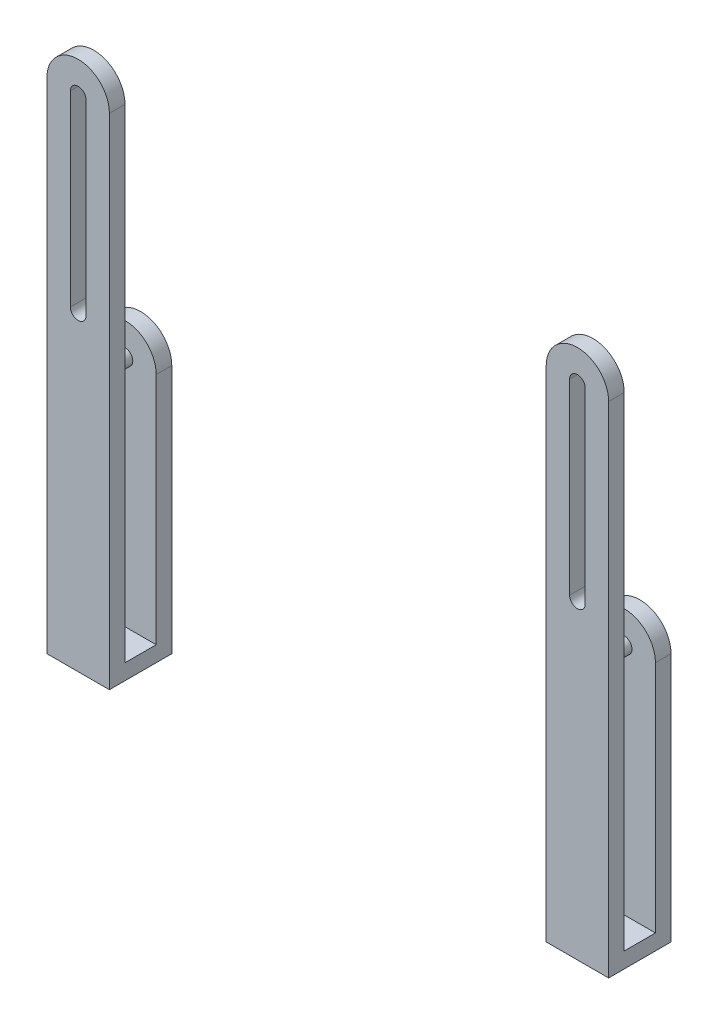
ISO-10303-21;
HEADER;
FILE_DESCRIPTION(('STEP AP214'),'2;1');
FILE_NAME('part.step','',(''),(''),'','','');
FILE_SCHEMA(('AUTOMOTIVE_DESIGN { 1 0 10303 214 1 1 1 1 }'));
ENDSEC;
DATA;
#1=APPLICATION_CONTEXT('core data for automotive mechanical design processes');
#2=APPLICATION_PROTOCOL_DEFINITION('international standard','automotive_design',2000,#1);
#3=PRODUCT_CONTEXT('',#1,'mechanical');
#4=PRODUCT('Part','Part','',(#3));
#5=PRODUCT_RELATED_PRODUCT_CATEGORY('part','',(#4));
#6=PRODUCT_DEFINITION_FORMATION('','',#4);
#7=PRODUCT_DEFINITION_CONTEXT('part definition',#1,'design');
#8=PRODUCT_DEFINITION('design','',#6,#7);
#9=PRODUCT_DEFINITION_SHAPE('','',#8);
#10=(LENGTH_UNIT() NAMED_UNIT(*) SI_UNIT(.MILLI.,.METRE.));
#11=(NAMED_UNIT(*) PLANE_ANGLE_UNIT() SI_UNIT($,.RADIAN.));
#12=(NAMED_UNIT(*) SI_UNIT($,.STERADIAN.) SOLID_ANGLE_UNIT());
#13=UNCERTAINTY_MEASURE_WITH_UNIT(LENGTH_MEASURE(1.E-05),#10,'distance_accuracy_value','');
#14=(GEOMETRIC_REPRESENTATION_CONTEXT(3) GLOBAL_UNCERTAINTY_ASSIGNED_CONTEXT((#13)) GLOBAL_UNIT_ASSIGNED_CONTEXT((#10,
#11,#12)) REPRESENTATION_CONTEXT('',''));
#15=CARTESIAN_POINT('',(0.,0.,0.));
#16=DIRECTION('',(0.,0.,1.));
#17=DIRECTION('',(1.,0.,0.));
#18=AXIS2_PLACEMENT_3D('',#15,#16,#17);
#19=CARTESIAN_POINT('',(-406.4,203.2,12.7));
#20=DIRECTION('',(0.,0.,1.));
#21=DIRECTION('',(1.,0.,0.));
#22=AXIS2_PLACEMENT_3D('',#19,#20,#21);
#23=PLANE('',#22);
#24=DIRECTION('',(-1.,0.,0.));
#25=VECTOR('',#24,1.);
#26=CARTESIAN_POINT('',(-431.8,12.7,12.7));
#27=LINE('',#26,#25);
#28=CARTESIAN_POINT('',(-381.,12.7,12.7));
#29=VERTEX_POINT('',#28);
#30=CARTESIAN_POINT('',(-431.8,12.7,12.7));
#31=VERTEX_POINT('',#30);
#32=EDGE_CURVE('E182',#29,#31,#27,.T.);
#33=ORIENTED_EDGE('',*,*,#32,.F.);
#34=DIRECTION('',(0.,1.,0.));
#35=VECTOR('',#34,1.);
#36=CARTESIAN_POINT('',(-381.,0.,12.7));
#37=LINE('',#36,#35);
#38=CARTESIAN_POINT('',(-381.,203.2,12.7));
#39=VERTEX_POINT('',#38);
#40=EDGE_CURVE('E187',#29,#39,#37,.T.);
#41=ORIENTED_EDGE('',*,*,#40,.T.);
#42=CARTESIAN_POINT('',(-406.4,203.2,12.7));
#43=DIRECTION('',(0.,0.,1.));
#44=DIRECTION('',(1.,0.,0.));
#45=AXIS2_PLACEMENT_3D('',#42,#43,#44);
#46=CIRCLE('',#45,25.4);
#47=CARTESIAN_POINT('',(-431.8,203.2,12.7));
#48=VERTEX_POINT('',#47);
#49=EDGE_CURVE('E223',#39,#48,#46,.T.);
#50=ORIENTED_EDGE('',*,*,#49,.T.);
#51=DIRECTION('',(0.,-1.,0.));
#52=VECTOR('',#51,1.);
#53=CARTESIAN_POINT('',(-431.8,203.2,12.7));
#54=LINE('',#53,#52);
#55=EDGE_CURVE('E212',#48,#31,#54,.T.);
#56=ORIENTED_EDGE('',*,*,#55,.T.);
#57=EDGE_LOOP('',(#33,#41,#50,#56));
#58=FACE_BOUND('',#57,.T.);
#59=CARTESIAN_POINT('',(-406.4,203.2,12.7));
#60=DIRECTION('',(0.,0.,1.));
#61=DIRECTION('',(1.,0.,0.));
#62=AXIS2_PLACEMENT_3D('',#59,#60,#61);
#63=CIRCLE('',#62,6.35);
#64=CARTESIAN_POINT('',(-412.75,203.2,12.7));
#65=VERTEX_POINT('',#64);
#66=EDGE_CURVE('E326',#65,#65,#63,.T.);
#67=ORIENTED_EDGE('',*,*,#66,.F.);
#68=EDGE_LOOP('',(#67));
#69=FACE_BOUND('',#68,.T.);
#70=ADVANCED_FACE('F42',(#58,#69),#23,.T.);
#71=CARTESIAN_POINT('',(-431.8,203.2,12.7));
#72=DIRECTION('',(1.,0.,0.));
#73=DIRECTION('',(0.,1.,0.));
#74=AXIS2_PLACEMENT_3D('',#71,#72,#73);
#75=PLANE('',#74);
#76=DIRECTION('',(0.,-1.,0.));
#77=VECTOR('',#76,1.);
#78=CARTESIAN_POINT('',(-431.8,203.2,0.));
#79=LINE('',#78,#77);
#80=CARTESIAN_POINT('',(-431.8,203.2,0.));
#81=VERTEX_POINT('',#80);
#82=CARTESIAN_POINT('',(-431.8,0.,0.));
#83=VERTEX_POINT('',#82);
#84=EDGE_CURVE('E197',#81,#83,#79,.T.);
#85=ORIENTED_EDGE('',*,*,#84,.T.);
#86=DIRECTION('',(0.,0.,-1.));
#87=VECTOR('',#86,1.);
#88=CARTESIAN_POINT('',(-431.8,0.,12.7));
#89=LINE('',#88,#87);
#90=CARTESIAN_POINT('',(-431.8,0.,50.8));
#91=VERTEX_POINT('',#90);
#92=EDGE_CURVE('E12',#91,#83,#89,.T.);
#93=ORIENTED_EDGE('',*,*,#92,.F.);
#94=DIRECTION('',(0.,-1.,0.));
#95=VECTOR('',#94,1.);
#96=CARTESIAN_POINT('',(-431.8,0.,50.8));
#97=LINE('',#96,#95);
#98=CARTESIAN_POINT('',(-431.8,406.4,50.8));
#99=VERTEX_POINT('',#98);
#100=EDGE_CURVE('E258',#99,#91,#97,.T.);
#101=ORIENTED_EDGE('',*,*,#100,.F.);
#102=DIRECTION('',(0.,0.,-1.));
#103=VECTOR('',#102,1.);
#104=CARTESIAN_POINT('',(-431.8,406.4,50.8));
#105=LINE('',#104,#103);
#106=CARTESIAN_POINT('',(-431.8,406.4,38.1));
#107=VERTEX_POINT('',#106);
#108=EDGE_CURVE('E246',#99,#107,#105,.T.);
#109=ORIENTED_EDGE('',*,*,#108,.T.);
#110=DIRECTION('',(0.,-1.,0.));
#111=VECTOR('',#110,1.);
#112=CARTESIAN_POINT('',(-431.8,0.,38.1));
#113=LINE('',#112,#111);
#114=CARTESIAN_POINT('',(-431.8,12.7,38.1));
#115=VERTEX_POINT('',#114);
#116=EDGE_CURVE('E176',#107,#115,#113,.T.);
#117=ORIENTED_EDGE('',*,*,#116,.T.);
#118=DIRECTION('',(0.,0.,-1.));
#119=VECTOR('',#118,1.);
#120=CARTESIAN_POINT('',(-431.8,12.7,38.1));
#121=LINE('',#120,#119);
#122=EDGE_CURVE('E190',#115,#31,#121,.T.);
#123=ORIENTED_EDGE('',*,*,#122,.T.);
#124=ORIENTED_EDGE('',*,*,#55,.F.);
#125=DIRECTION('',(0.,0.,-1.));
#126=VECTOR('',#125,1.);
#127=CARTESIAN_POINT('',(-431.8,203.2,12.7));
#128=LINE('',#127,#126);
#129=EDGE_CURVE('E222',#48,#81,#128,.T.);
#130=ORIENTED_EDGE('',*,*,#129,.T.);
#131=EDGE_LOOP('',(#85,#93,#101,#109,#117,#123,#124,#130));
#132=FACE_BOUND('',#131,.T.);
#133=ADVANCED_FACE('F44',(#132),#75,.F.);
#134=CARTESIAN_POINT('',(-431.8,0.,12.7));
#135=DIRECTION('',(0.,1.,0.));
#136=DIRECTION('',(0.,0.,1.));
#137=AXIS2_PLACEMENT_3D('',#134,#135,#136);
#138=PLANE('',#137);
#139=DIRECTION('',(1.,0.,0.));
#140=VECTOR('',#139,1.);
#141=CARTESIAN_POINT('',(-431.8,0.,0.));
#142=LINE('',#141,#140);
#143=CARTESIAN_POINT('',(-381.,0.,0.));
#144=VERTEX_POINT('',#143);
#145=EDGE_CURVE('E202',#83,#144,#142,.T.);
#146=ORIENTED_EDGE('',*,*,#145,.T.);
#147=DIRECTION('',(0.,0.,-1.));
#148=VECTOR('',#147,1.);
#149=CARTESIAN_POINT('',(-381.,0.,12.7));
#150=LINE('',#149,#148);
#151=CARTESIAN_POINT('',(-381.,0.,50.8));
#152=VERTEX_POINT('',#151);
#153=EDGE_CURVE('E52',#152,#144,#150,.T.);
#154=ORIENTED_EDGE('',*,*,#153,.F.);
#155=DIRECTION('',(1.,0.,0.));
#156=VECTOR('',#155,1.);
#157=CARTESIAN_POINT('',(-381.,0.,50.8));
#158=LINE('',#157,#156);
#159=EDGE_CURVE('E247',#91,#152,#158,.T.);
#160=ORIENTED_EDGE('',*,*,#159,.F.);
#161=ORIENTED_EDGE('',*,*,#92,.T.);
#162=EDGE_LOOP('',(#146,#154,#160,#161));
#163=FACE_BOUND('',#162,.T.);
#164=ADVANCED_FACE('F271',(#163),#138,.F.);
#165=CARTESIAN_POINT('',(-381.,0.,12.7));
#166=DIRECTION('',(-1.,0.,0.));
#167=DIRECTION('',(0.,0.,1.));
#168=AXIS2_PLACEMENT_3D('',#165,#166,#167);
#169=PLANE('',#168);
#170=DIRECTION('',(0.,1.,0.));
#171=VECTOR('',#170,1.);
#172=CARTESIAN_POINT('',(-381.,0.,0.));
#173=LINE('',#172,#171);
#174=CARTESIAN_POINT('',(-381.,203.2,0.));
#175=VERTEX_POINT('',#174);
#176=EDGE_CURVE('E206',#144,#175,#173,.T.);
#177=ORIENTED_EDGE('',*,*,#176,.T.);
#178=DIRECTION('',(0.,0.,-1.));
#179=VECTOR('',#178,1.);
#180=CARTESIAN_POINT('',(-381.,203.2,12.7));
#181=LINE('',#180,#179);
#182=EDGE_CURVE('E219',#39,#175,#181,.T.);
#183=ORIENTED_EDGE('',*,*,#182,.F.);
#184=ORIENTED_EDGE('',*,*,#40,.F.);
#185=DIRECTION('',(0.,0.,-1.));
#186=VECTOR('',#185,1.);
#187=CARTESIAN_POINT('',(-381.,12.7,38.1));
#188=LINE('',#187,#186);
#189=CARTESIAN_POINT('',(-381.,12.7,38.1));
#190=VERTEX_POINT('',#189);
#191=EDGE_CURVE('E193',#190,#29,#188,.T.);
#192=ORIENTED_EDGE('',*,*,#191,.F.);
#193=DIRECTION('',(0.,1.,0.));
#194=VECTOR('',#193,1.);
#195=CARTESIAN_POINT('',(-381.,406.4,38.1));
#196=LINE('',#195,#194);
#197=CARTESIAN_POINT('',(-381.,406.4,38.1));
#198=VERTEX_POINT('',#197);
#199=EDGE_CURVE('E140',#190,#198,#196,.T.);
#200=ORIENTED_EDGE('',*,*,#199,.T.);
#201=DIRECTION('',(0.,0.,-1.));
#202=VECTOR('',#201,1.);
#203=CARTESIAN_POINT('',(-381.,406.4,50.8));
#204=LINE('',#203,#202);
#205=CARTESIAN_POINT('',(-381.,406.4,50.8));
#206=VERTEX_POINT('',#205);
#207=EDGE_CURVE('E186',#206,#198,#204,.T.);
#208=ORIENTED_EDGE('',*,*,#207,.F.);
#209=DIRECTION('',(0.,1.,0.));
#210=VECTOR('',#209,1.);
#211=CARTESIAN_POINT('',(-381.,406.4,50.8));
#212=LINE('',#211,#210);
#213=EDGE_CURVE('E249',#152,#206,#212,.T.);
#214=ORIENTED_EDGE('',*,*,#213,.F.);
#215=ORIENTED_EDGE('',*,*,#153,.T.);
#216=EDGE_LOOP('',(#177,#183,#184,#192,#200,#208,#214,#215));
#217=FACE_BOUND('',#216,.T.);
#218=ADVANCED_FACE('F231',(#217),#169,.F.);
#219=CARTESIAN_POINT('',(-406.4,203.2,12.7));
#220=DIRECTION('',(0.,0.,-1.));
#221=DIRECTION('',(-1.,0.,0.));
#222=AXIS2_PLACEMENT_3D('',#219,#220,#221);
#223=CYLINDRICAL_SURFACE('',#222,25.4);
#224=CARTESIAN_POINT('',(-406.4,203.2,0.));
#225=DIRECTION('',(0.,0.,1.));
#226=DIRECTION('',(1.,0.,0.));
#227=AXIS2_PLACEMENT_3D('',#224,#225,#226);
#228=CIRCLE('',#227,25.4);
#229=EDGE_CURVE('E210',#175,#81,#228,.T.);
#230=ORIENTED_EDGE('',*,*,#229,.T.);
#231=ORIENTED_EDGE('',*,*,#129,.F.);
#232=ORIENTED_EDGE('',*,*,#49,.F.);
#233=ORIENTED_EDGE('',*,*,#182,.T.);
#234=EDGE_LOOP('',(#230,#231,#232,#233));
#235=FACE_BOUND('',#234,.T.);
#236=ADVANCED_FACE('F235',(#235),#223,.T.);
#237=CARTESIAN_POINT('',(-406.4,203.2,0.));
#238=DIRECTION('',(0.,0.,1.));
#239=DIRECTION('',(1.,0.,0.));
#240=AXIS2_PLACEMENT_3D('',#237,#238,#239);
#241=PLANE('',#240);
#242=ORIENTED_EDGE('',*,*,#84,.F.);
#243=ORIENTED_EDGE('',*,*,#229,.F.);
#244=ORIENTED_EDGE('',*,*,#176,.F.);
#245=ORIENTED_EDGE('',*,*,#145,.F.);
#246=EDGE_LOOP('',(#242,#243,#244,#245));
#247=FACE_BOUND('',#246,.T.);
#248=ADVANCED_FACE('F270',(#247),#241,.F.);
#249=CARTESIAN_POINT('',(-431.8,12.7,38.1));
#250=DIRECTION('',(0.,-1.,0.));
#251=DIRECTION('',(0.,0.,-1.));
#252=AXIS2_PLACEMENT_3D('',#249,#250,#251);
#253=PLANE('',#252);
#254=ORIENTED_EDGE('',*,*,#32,.T.);
#255=ORIENTED_EDGE('',*,*,#122,.F.);
#256=DIRECTION('',(-1.,0.,0.));
#257=VECTOR('',#256,1.);
#258=CARTESIAN_POINT('',(-431.8,12.7,38.1));
#259=LINE('',#258,#257);
#260=EDGE_CURVE('E46',#190,#115,#259,.T.);
#261=ORIENTED_EDGE('',*,*,#260,.F.);
#262=ORIENTED_EDGE('',*,*,#191,.T.);
#263=EDGE_LOOP('',(#254,#255,#261,#262));
#264=FACE_BOUND('',#263,.T.);
#265=ADVANCED_FACE('F238',(#264),#253,.F.);
#266=CARTESIAN_POINT('',(-406.4,406.4,50.8));
#267=DIRECTION('',(0.,0.,-1.));
#268=DIRECTION('',(-1.,0.,0.));
#269=AXIS2_PLACEMENT_3D('',#266,#267,#268);
#270=CYLINDRICAL_SURFACE('',#269,25.4);
#271=CARTESIAN_POINT('',(-406.4,406.4,38.1));
#272=DIRECTION('',(0.,0.,1.));
#273=DIRECTION('',(-1.,0.,0.));
#274=AXIS2_PLACEMENT_3D('',#271,#272,#273);
#275=CIRCLE('',#274,25.4);
#276=EDGE_CURVE('E171',#198,#107,#275,.T.);
#277=ORIENTED_EDGE('',*,*,#276,.T.);
#278=ORIENTED_EDGE('',*,*,#108,.F.);
#279=CARTESIAN_POINT('',(-406.4,406.4,50.8));
#280=DIRECTION('',(0.,0.,1.));
#281=DIRECTION('',(-1.,0.,0.));
#282=AXIS2_PLACEMENT_3D('',#279,#280,#281);
#283=CIRCLE('',#282,25.4);
#284=EDGE_CURVE('E256',#206,#99,#283,.T.);
#285=ORIENTED_EDGE('',*,*,#284,.F.);
#286=ORIENTED_EDGE('',*,*,#207,.T.);
#287=EDGE_LOOP('',(#277,#278,#285,#286));
#288=FACE_BOUND('',#287,.T.);
#289=ADVANCED_FACE('F253',(#288),#270,.T.);
#290=CARTESIAN_POINT('',(-406.4,406.4,50.8));
#291=DIRECTION('',(0.,0.,-1.));
#292=DIRECTION('',(-1.,0.,0.));
#293=AXIS2_PLACEMENT_3D('',#290,#291,#292);
#294=PLANE('',#293);
#295=DIRECTION('',(0.,-1.,0.));
#296=VECTOR('',#295,1.);
#297=CARTESIAN_POINT('',(-412.75,406.4,50.8));
#298=LINE('',#297,#296);
#299=CARTESIAN_POINT('',(-412.75,406.4,50.8));
#300=VERTEX_POINT('',#299);
#301=CARTESIAN_POINT('',(-412.75,254.,50.8));
#302=VERTEX_POINT('',#301);
#303=EDGE_CURVE('E153',#300,#302,#298,.T.);
#304=ORIENTED_EDGE('',*,*,#303,.F.);
#305=CARTESIAN_POINT('',(-406.4,406.4,50.8));
#306=DIRECTION('',(0.,0.,1.));
#307=DIRECTION('',(-1.,0.,0.));
#308=AXIS2_PLACEMENT_3D('',#305,#306,#307);
#309=CIRCLE('',#308,6.35);
#310=CARTESIAN_POINT('',(-400.05,406.4,50.8));
#311=VERTEX_POINT('',#310);
#312=EDGE_CURVE('E60',#311,#300,#309,.T.);
#313=ORIENTED_EDGE('',*,*,#312,.F.);
#314=DIRECTION('',(0.,1.,0.));
#315=VECTOR('',#314,1.);
#316=CARTESIAN_POINT('',(-400.05,406.4,50.8));
#317=LINE('',#316,#315);
#318=CARTESIAN_POINT('',(-400.05,254.,50.8));
#319=VERTEX_POINT('',#318);
#320=EDGE_CURVE('E146',#319,#311,#317,.T.);
#321=ORIENTED_EDGE('',*,*,#320,.F.);
#322=CARTESIAN_POINT('',(-406.4,254.,50.8));
#323=DIRECTION('',(0.,0.,1.));
#324=DIRECTION('',(1.,0.,0.));
#325=AXIS2_PLACEMENT_3D('',#322,#323,#324);
#326=CIRCLE('',#325,6.35);
#327=EDGE_CURVE('E160',#302,#319,#326,.T.);
#328=ORIENTED_EDGE('',*,*,#327,.F.);
#329=EDGE_LOOP('',(#304,#313,#321,#328));
#330=FACE_BOUND('',#329,.T.);
#331=ORIENTED_EDGE('',*,*,#159,.T.);
#332=ORIENTED_EDGE('',*,*,#213,.T.);
#333=ORIENTED_EDGE('',*,*,#284,.T.);
#334=ORIENTED_EDGE('',*,*,#100,.T.);
#335=EDGE_LOOP('',(#331,#332,#333,#334));
#336=FACE_BOUND('',#335,.T.);
#337=ADVANCED_FACE('F266',(#330,#336),#294,.F.);
#338=CARTESIAN_POINT('',(-406.4,406.4,38.1));
#339=DIRECTION('',(0.,0.,-1.));
#340=DIRECTION('',(-1.,0.,0.));
#341=AXIS2_PLACEMENT_3D('',#338,#339,#340);
#342=PLANE('',#341);
#343=CARTESIAN_POINT('',(-406.4,406.4,38.1));
#344=DIRECTION('',(0.,0.,-1.));
#345=DIRECTION('',(-1.,0.,0.));
#346=AXIS2_PLACEMENT_3D('',#343,#344,#345);
#347=CIRCLE('',#346,6.35);
#348=CARTESIAN_POINT('',(-400.05,406.4,38.1));
#349=VERTEX_POINT('',#348);
#350=CARTESIAN_POINT('',(-412.75,406.4,38.1));
#351=VERTEX_POINT('',#350);
#352=EDGE_CURVE('E144',#349,#351,#347,.F.);
#353=ORIENTED_EDGE('',*,*,#352,.T.);
#354=DIRECTION('',(0.,-1.,0.));
#355=VECTOR('',#354,1.);
#356=CARTESIAN_POINT('',(-412.75,406.4,38.1));
#357=LINE('',#356,#355);
#358=CARTESIAN_POINT('',(-412.75,254.,38.1));
#359=VERTEX_POINT('',#358);
#360=EDGE_CURVE('E133',#351,#359,#357,.T.);
#361=ORIENTED_EDGE('',*,*,#360,.T.);
#362=CARTESIAN_POINT('',(-406.4,254.,38.1));
#363=DIRECTION('',(0.,0.,-1.));
#364=DIRECTION('',(-1.,0.,0.));
#365=AXIS2_PLACEMENT_3D('',#362,#363,#364);
#366=CIRCLE('',#365,6.35);
#367=CARTESIAN_POINT('',(-400.05,254.,38.1));
#368=VERTEX_POINT('',#367);
#369=EDGE_CURVE('E155',#359,#368,#366,.F.);
#370=ORIENTED_EDGE('',*,*,#369,.T.);
#371=DIRECTION('',(0.,1.,0.));
#372=VECTOR('',#371,1.);
#373=CARTESIAN_POINT('',(-400.05,406.4,38.1));
#374=LINE('',#373,#372);
#375=EDGE_CURVE('E151',#368,#349,#374,.T.);
#376=ORIENTED_EDGE('',*,*,#375,.T.);
#377=EDGE_LOOP('',(#353,#361,#370,#376));
#378=FACE_BOUND('',#377,.T.);
#379=ORIENTED_EDGE('',*,*,#199,.F.);
#380=ORIENTED_EDGE('',*,*,#260,.T.);
#381=ORIENTED_EDGE('',*,*,#116,.F.);
#382=ORIENTED_EDGE('',*,*,#276,.F.);
#383=EDGE_LOOP('',(#379,#380,#381,#382));
#384=FACE_BOUND('',#383,.T.);
#385=ADVANCED_FACE('F149',(#378,#384),#342,.T.);
#386=CARTESIAN_POINT('',(-406.4,406.4,-0.001000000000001));
#387=DIRECTION('',(0.,0.,1.));
#388=DIRECTION('',(1.,0.,0.));
#389=AXIS2_PLACEMENT_3D('',#386,#387,#388);
#390=CYLINDRICAL_SURFACE('',#389,6.35);
#391=DIRECTION('',(0.,0.,1.));
#392=VECTOR('',#391,1.);
#393=CARTESIAN_POINT('',(-400.05,406.4,-0.001000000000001));
#394=LINE('',#393,#392);
#395=EDGE_CURVE('E141',#349,#311,#394,.T.);
#396=ORIENTED_EDGE('',*,*,#395,.T.);
#397=ORIENTED_EDGE('',*,*,#312,.T.);
#398=DIRECTION('',(0.,0.,1.));
#399=VECTOR('',#398,1.);
#400=CARTESIAN_POINT('',(-412.75,406.4,-0.001000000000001));
#401=LINE('',#400,#399);
#402=EDGE_CURVE('E135',#351,#300,#401,.T.);
#403=ORIENTED_EDGE('',*,*,#402,.F.);
#404=ORIENTED_EDGE('',*,*,#352,.F.);
#405=EDGE_LOOP('',(#396,#397,#403,#404));
#406=FACE_BOUND('',#405,.T.);
#407=ADVANCED_FACE('F143',(#406),#390,.F.);
#408=CARTESIAN_POINT('',(-400.05,406.4,-0.001000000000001));
#409=DIRECTION('',(1.,0.,0.));
#410=DIRECTION('',(0.,1.,0.));
#411=AXIS2_PLACEMENT_3D('',#408,#409,#410);
#412=PLANE('',#411);
#413=DIRECTION('',(0.,0.,1.));
#414=VECTOR('',#413,1.);
#415=CARTESIAN_POINT('',(-400.05,254.,-0.001000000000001));
#416=LINE('',#415,#414);
#417=EDGE_CURVE('E166',#368,#319,#416,.T.);
#418=ORIENTED_EDGE('',*,*,#417,.T.);
#419=ORIENTED_EDGE('',*,*,#320,.T.);
#420=ORIENTED_EDGE('',*,*,#395,.F.);
#421=ORIENTED_EDGE('',*,*,#375,.F.);
#422=EDGE_LOOP('',(#418,#419,#420,#421));
#423=FACE_BOUND('',#422,.T.);
#424=ADVANCED_FACE('F304',(#423),#412,.F.);
#425=CARTESIAN_POINT('',(-406.4,254.,-0.001000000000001));
#426=DIRECTION('',(0.,0.,1.));
#427=DIRECTION('',(1.,0.,0.));
#428=AXIS2_PLACEMENT_3D('',#425,#426,#427);
#429=CYLINDRICAL_SURFACE('',#428,6.35);
#430=DIRECTION('',(0.,0.,1.));
#431=VECTOR('',#430,1.);
#432=CARTESIAN_POINT('',(-412.75,254.,-0.001000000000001));
#433=LINE('',#432,#431);
#434=EDGE_CURVE('E68',#359,#302,#433,.T.);
#435=ORIENTED_EDGE('',*,*,#434,.T.);
#436=ORIENTED_EDGE('',*,*,#327,.T.);
#437=ORIENTED_EDGE('',*,*,#417,.F.);
#438=ORIENTED_EDGE('',*,*,#369,.F.);
#439=EDGE_LOOP('',(#435,#436,#437,#438));
#440=FACE_BOUND('',#439,.T.);
#441=ADVANCED_FACE('F308',(#440),#429,.F.);
#442=CARTESIAN_POINT('',(-412.75,406.4,-0.001000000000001));
#443=DIRECTION('',(-1.,0.,0.));
#444=DIRECTION('',(0.,-1.,0.));
#445=AXIS2_PLACEMENT_3D('',#442,#443,#444);
#446=PLANE('',#445);
#447=ORIENTED_EDGE('',*,*,#402,.T.);
#448=ORIENTED_EDGE('',*,*,#303,.T.);
#449=ORIENTED_EDGE('',*,*,#434,.F.);
#450=ORIENTED_EDGE('',*,*,#360,.F.);
#451=EDGE_LOOP('',(#447,#448,#449,#450));
#452=FACE_BOUND('',#451,.T.);
#453=ADVANCED_FACE('F134',(#452),#446,.F.);
#454=CARTESIAN_POINT('',(-406.4,203.2,31.75));
#455=DIRECTION('',(0.,0.,-1.));
#456=DIRECTION('',(-1.,0.,0.));
#457=AXIS2_PLACEMENT_3D('',#454,#455,#456);
#458=CYLINDRICAL_SURFACE('',#457,6.35);
#459=CARTESIAN_POINT('',(-406.4,203.2,31.75));
#460=DIRECTION('',(0.,0.,1.));
#461=DIRECTION('',(1.,0.,0.));
#462=AXIS2_PLACEMENT_3D('',#459,#460,#461);
#463=CIRCLE('',#462,6.35);
#464=CARTESIAN_POINT('',(-412.75,203.2,31.75));
#465=VERTEX_POINT('',#464);
#466=EDGE_CURVE('E325',#465,#465,#463,.T.);
#467=CARTESIAN_POINT('',(-412.75,203.2,31.75));
#468=CARTESIAN_POINT('',(-412.75,203.2,31.5515625));
#469=CARTESIAN_POINT('',(-412.75,203.2,31.353125));
#470=CARTESIAN_POINT('',(-412.75,203.2,30.95625));
#471=CARTESIAN_POINT('',(-412.75,203.2,30.7578125));
#472=CARTESIAN_POINT('',(-412.75,203.2,30.3609375));
#473=CARTESIAN_POINT('',(-412.75,203.2,30.1625));
#474=CARTESIAN_POINT('',(-412.75,203.2,29.765625));
#475=CARTESIAN_POINT('',(-412.75,203.2,29.5671875));
#476=CARTESIAN_POINT('',(-412.75,203.2,29.1703125));
#477=CARTESIAN_POINT('',(-412.75,203.2,28.971875));
#478=CARTESIAN_POINT('',(-412.75,203.2,28.575));
#479=CARTESIAN_POINT('',(-412.75,203.2,28.3765625));
#480=CARTESIAN_POINT('',(-412.75,203.2,27.9796875));
#481=CARTESIAN_POINT('',(-412.75,203.2,27.78125));
#482=CARTESIAN_POINT('',(-412.75,203.2,27.384375));
#483=CARTESIAN_POINT('',(-412.75,203.2,27.1859375));
#484=CARTESIAN_POINT('',(-412.75,203.2,26.7890625));
#485=CARTESIAN_POINT('',(-412.75,203.2,26.590625));
#486=CARTESIAN_POINT('',(-412.75,203.2,26.19375));
#487=CARTESIAN_POINT('',(-412.75,203.2,25.9953125));
#488=CARTESIAN_POINT('',(-412.75,203.2,25.5984375));
#489=CARTESIAN_POINT('',(-412.75,203.2,25.4));
#490=CARTESIAN_POINT('',(-412.75,203.2,25.003125));
#491=CARTESIAN_POINT('',(-412.75,203.2,24.8046875));
#492=CARTESIAN_POINT('',(-412.75,203.2,24.4078125));
#493=CARTESIAN_POINT('',(-412.75,203.2,24.209375));
#494=CARTESIAN_POINT('',(-412.75,203.2,23.8125));
#495=CARTESIAN_POINT('',(-412.75,203.2,23.6140625));
#496=CARTESIAN_POINT('',(-412.75,203.2,23.2171875));
#497=CARTESIAN_POINT('',(-412.75,203.2,23.01875));
#498=CARTESIAN_POINT('',(-412.75,203.2,22.621875));
#499=CARTESIAN_POINT('',(-412.75,203.2,22.4234375));
#500=CARTESIAN_POINT('',(-412.75,203.2,22.0265625));
#501=CARTESIAN_POINT('',(-412.75,203.2,21.828125));
#502=CARTESIAN_POINT('',(-412.75,203.2,21.43125));
#503=CARTESIAN_POINT('',(-412.75,203.2,21.2328125));
#504=CARTESIAN_POINT('',(-412.75,203.2,20.8359375));
#505=CARTESIAN_POINT('',(-412.75,203.2,20.6375));
#506=CARTESIAN_POINT('',(-412.75,203.2,20.240625));
#507=CARTESIAN_POINT('',(-412.75,203.2,20.0421875));
#508=CARTESIAN_POINT('',(-412.75,203.2,19.6453125));
#509=CARTESIAN_POINT('',(-412.75,203.2,19.446875));
#510=CARTESIAN_POINT('',(-412.75,203.2,19.05));
#511=CARTESIAN_POINT('',(-412.75,203.2,18.8515625));
#512=CARTESIAN_POINT('',(-412.75,203.2,18.4546875));
#513=CARTESIAN_POINT('',(-412.75,203.2,18.25625));
#514=CARTESIAN_POINT('',(-412.75,203.2,17.859375));
#515=CARTESIAN_POINT('',(-412.75,203.2,17.6609375));
#516=CARTESIAN_POINT('',(-412.75,203.2,17.2640625));
#517=CARTESIAN_POINT('',(-412.75,203.2,17.065625));
#518=CARTESIAN_POINT('',(-412.75,203.2,16.66875));
#519=CARTESIAN_POINT('',(-412.75,203.2,16.4703125));
#520=CARTESIAN_POINT('',(-412.75,203.2,16.0734375));
#521=CARTESIAN_POINT('',(-412.75,203.2,15.875));
#522=CARTESIAN_POINT('',(-412.75,203.2,15.478125));
#523=CARTESIAN_POINT('',(-412.75,203.2,15.2796875));
#524=CARTESIAN_POINT('',(-412.75,203.2,14.8828125));
#525=CARTESIAN_POINT('',(-412.75,203.2,14.684375));
#526=CARTESIAN_POINT('',(-412.75,203.2,14.2875));
#527=CARTESIAN_POINT('',(-412.75,203.2,14.0890625));
#528=CARTESIAN_POINT('',(-412.75,203.2,13.6921875));
#529=CARTESIAN_POINT('',(-412.75,203.2,13.49375));
#530=CARTESIAN_POINT('',(-412.75,203.2,13.096875));
#531=CARTESIAN_POINT('',(-412.75,203.2,12.8984375));
#532=CARTESIAN_POINT('',(-412.75,203.2,12.7));
#533=B_SPLINE_CURVE_WITH_KNOTS('',3,(#467,#468,#469,#470,#471,#472,#473,#474,#475,#476,#477,
#478,#479,#480,#481,#482,#483,#484,#485,#486,#487,#488,#489,#490,#491,#492,#493,#494,#495,#496,
#497,#498,#499,#500,#501,#502,#503,#504,#505,#506,#507,#508,#509,#510,#511,#512,#513,#514,#515,
#516,#517,#518,#519,#520,#521,#522,#523,#524,#525,#526,#527,#528,#529,#530,#531,#532),
.UNSPECIFIED.,.F.,.F.,(4,2,2,2,2,2,2,2,2,2,2,2,2,2,2,2,2,2,2,2,2,2,2,2,2,2,2,2,2,2,2,2,4),(0.,
0.595312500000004,1.190625,1.7859375,2.38125,2.9765625,3.571875,4.1671875,4.7625,5.3578125,
5.953125,6.5484375,7.14375,7.7390625,8.334375,8.9296875,9.525,10.1203125,10.715625,11.3109375,
11.90625,12.5015625,13.096875,13.6921875,14.2875,14.8828125,15.478125,16.0734375,16.66875,
17.2640625,17.859375,18.4546875,19.05),.UNSPECIFIED.);
#534=EDGE_CURVE('BSEAM307',#465,#65,#533,.T.);
#535=ORIENTED_EDGE('',*,*,#466,.F.);
#536=ORIENTED_EDGE('',*,*,#66,.T.);
#537=ORIENTED_EDGE('',*,*,#534,.T.);
#538=ORIENTED_EDGE('',*,*,#534,.F.);
#539=EDGE_LOOP('',(#535,#537,#536,#538));
#540=FACE_BOUND('',#539,.T.);
#541=ADVANCED_FACE('F307',(#540),#458,.T.);
#542=CARTESIAN_POINT('',(-406.4,203.2,31.75));
#543=DIRECTION('',(0.,0.,1.));
#544=DIRECTION('',(1.,0.,0.));
#545=AXIS2_PLACEMENT_3D('',#542,#543,#544);
#546=PLANE('',#545);
#547=ORIENTED_EDGE('',*,*,#466,.T.);
#548=EDGE_LOOP('',(#547));
#549=FACE_BOUND('',#548,.T.);
#550=ADVANCED_FACE('F317',(#549),#546,.T.);
#551=CLOSED_SHELL('',(#70,#133,#164,#218,#236,#248,#265,#289,#337,#385,#407,#424,#441,#453,#541,#550));
#552=MANIFOLD_SOLID_BREP('B2',#551);
#553=CARTESIAN_POINT('',(0.,203.2,12.7));
#554=DIRECTION('',(0.,0.,1.));
#555=DIRECTION('',(1.,0.,0.));
#556=AXIS2_PLACEMENT_3D('',#553,#554,#555);
#557=PLANE('',#556);
#558=DIRECTION('',(-1.,0.,0.));
#559=VECTOR('',#558,1.);
#560=CARTESIAN_POINT('',(-25.4,12.7,12.7));
#561=LINE('',#560,#559);
#562=CARTESIAN_POINT('',(25.4,12.7,12.7));
#563=VERTEX_POINT('',#562);
#564=CARTESIAN_POINT('',(-25.4,12.7,12.7));
#565=VERTEX_POINT('',#564);
#566=EDGE_CURVE('E579',#563,#565,#561,.T.);
#567=ORIENTED_EDGE('',*,*,#566,.F.);
#568=DIRECTION('',(0.,1.,0.));
#569=VECTOR('',#568,1.);
#570=CARTESIAN_POINT('',(25.4,0.,12.7));
#571=LINE('',#570,#569);
#572=CARTESIAN_POINT('',(25.4,203.2,12.7));
#573=VERTEX_POINT('',#572);
#574=EDGE_CURVE('E584',#563,#573,#571,.T.);
#575=ORIENTED_EDGE('',*,*,#574,.T.);
#576=CARTESIAN_POINT('',(0.,203.2,12.7));
#577=DIRECTION('',(0.,0.,1.));
#578=DIRECTION('',(1.,0.,0.));
#579=AXIS2_PLACEMENT_3D('',#576,#577,#578);
#580=CIRCLE('',#579,25.4);
#581=CARTESIAN_POINT('',(-25.4,203.2,12.7));
#582=VERTEX_POINT('',#581);
#583=EDGE_CURVE('E620',#573,#582,#580,.T.);
#584=ORIENTED_EDGE('',*,*,#583,.T.);
#585=DIRECTION('',(0.,-1.,0.));
#586=VECTOR('',#585,1.);
#587=CARTESIAN_POINT('',(-25.4,203.2,12.7));
#588=LINE('',#587,#586);
#589=EDGE_CURVE('E609',#582,#565,#588,.T.);
#590=ORIENTED_EDGE('',*,*,#589,.T.);
#591=EDGE_LOOP('',(#567,#575,#584,#590));
#592=FACE_BOUND('',#591,.T.);
#593=CARTESIAN_POINT('',(0.,203.2,12.7));
#594=DIRECTION('',(0.,0.,1.));
#595=DIRECTION('',(1.,0.,0.));
#596=AXIS2_PLACEMENT_3D('',#593,#594,#595);
#597=CIRCLE('',#596,6.35);
#598=CARTESIAN_POINT('',(-6.35,203.2,12.7));
#599=VERTEX_POINT('',#598);
#600=EDGE_CURVE('E723',#599,#599,#597,.T.);
#601=ORIENTED_EDGE('',*,*,#600,.F.);
#602=EDGE_LOOP('',(#601));
#603=FACE_BOUND('',#602,.T.);
#604=ADVANCED_FACE('F439',(#592,#603),#557,.T.);
#605=CARTESIAN_POINT('',(-25.4,203.2,12.7));
#606=DIRECTION('',(1.,0.,0.));
#607=DIRECTION('',(0.,1.,0.));
#608=AXIS2_PLACEMENT_3D('',#605,#606,#607);
#609=PLANE('',#608);
#610=DIRECTION('',(0.,-1.,0.));
#611=VECTOR('',#610,1.);
#612=CARTESIAN_POINT('',(-25.4,203.2,0.));
#613=LINE('',#612,#611);
#614=CARTESIAN_POINT('',(-25.4,203.2,0.));
#615=VERTEX_POINT('',#614);
#616=CARTESIAN_POINT('',(-25.4,0.,0.));
#617=VERTEX_POINT('',#616);
#618=EDGE_CURVE('E594',#615,#617,#613,.T.);
#619=ORIENTED_EDGE('',*,*,#618,.T.);
#620=DIRECTION('',(0.,0.,-1.));
#621=VECTOR('',#620,1.);
#622=CARTESIAN_POINT('',(-25.4,0.,12.7));
#623=LINE('',#622,#621);
#624=CARTESIAN_POINT('',(-25.4,0.,50.8));
#625=VERTEX_POINT('',#624);
#626=EDGE_CURVE('E40',#625,#617,#623,.T.);
#627=ORIENTED_EDGE('',*,*,#626,.F.);
#628=DIRECTION('',(0.,-1.,0.));
#629=VECTOR('',#628,1.);
#630=CARTESIAN_POINT('',(-25.4,0.,50.8));
#631=LINE('',#630,#629);
#632=CARTESIAN_POINT('',(-25.4,406.4,50.8));
#633=VERTEX_POINT('',#632);
#634=EDGE_CURVE('E655',#633,#625,#631,.T.);
#635=ORIENTED_EDGE('',*,*,#634,.F.);
#636=DIRECTION('',(0.,0.,-1.));
#637=VECTOR('',#636,1.);
#638=CARTESIAN_POINT('',(-25.4,406.4,50.8));
#639=LINE('',#638,#637);
#640=CARTESIAN_POINT('',(-25.4,406.4,38.1));
#641=VERTEX_POINT('',#640);
#642=EDGE_CURVE('E643',#633,#641,#639,.T.);
#643=ORIENTED_EDGE('',*,*,#642,.T.);
#644=DIRECTION('',(0.,-1.,0.));
#645=VECTOR('',#644,1.);
#646=CARTESIAN_POINT('',(-25.4,0.,38.1));
#647=LINE('',#646,#645);
#648=CARTESIAN_POINT('',(-25.4,12.7,38.1));
#649=VERTEX_POINT('',#648);
#650=EDGE_CURVE('E573',#641,#649,#647,.T.);
#651=ORIENTED_EDGE('',*,*,#650,.T.);
#652=DIRECTION('',(0.,0.,-1.));
#653=VECTOR('',#652,1.);
#654=CARTESIAN_POINT('',(-25.4,12.7,38.1));
#655=LINE('',#654,#653);
#656=EDGE_CURVE('E587',#649,#565,#655,.T.);
#657=ORIENTED_EDGE('',*,*,#656,.T.);
#658=ORIENTED_EDGE('',*,*,#589,.F.);
#659=DIRECTION('',(0.,0.,-1.));
#660=VECTOR('',#659,1.);
#661=CARTESIAN_POINT('',(-25.4,203.2,12.7));
#662=LINE('',#661,#660);
#663=EDGE_CURVE('E619',#582,#615,#662,.T.);
#664=ORIENTED_EDGE('',*,*,#663,.T.);
#665=EDGE_LOOP('',(#619,#627,#635,#643,#651,#657,#658,#664));
#666=FACE_BOUND('',#665,.T.);
#667=ADVANCED_FACE('F441',(#666),#609,.F.);
#668=CARTESIAN_POINT('',(-25.4,0.,12.7));
#669=DIRECTION('',(0.,1.,0.));
#670=DIRECTION('',(0.,0.,1.));
#671=AXIS2_PLACEMENT_3D('',#668,#669,#670);
#672=PLANE('',#671);
#673=DIRECTION('',(1.,0.,0.));
#674=VECTOR('',#673,1.);
#675=CARTESIAN_POINT('',(-25.4,0.,0.));
#676=LINE('',#675,#674);
#677=CARTESIAN_POINT('',(25.4,0.,0.));
#678=VERTEX_POINT('',#677);
#679=EDGE_CURVE('E599',#617,#678,#676,.T.);
#680=ORIENTED_EDGE('',*,*,#679,.T.);
#681=DIRECTION('',(0.,0.,-1.));
#682=VECTOR('',#681,1.);
#683=CARTESIAN_POINT('',(25.4,0.,12.7));
#684=LINE('',#683,#682);
#685=CARTESIAN_POINT('',(25.4,0.,50.8));
#686=VERTEX_POINT('',#685);
#687=EDGE_CURVE('E449',#686,#678,#684,.T.);
#688=ORIENTED_EDGE('',*,*,#687,.F.);
#689=DIRECTION('',(1.,0.,0.));
#690=VECTOR('',#689,1.);
#691=CARTESIAN_POINT('',(25.4,0.,50.8));
#692=LINE('',#691,#690);
#693=EDGE_CURVE('E644',#625,#686,#692,.T.);
#694=ORIENTED_EDGE('',*,*,#693,.F.);
#695=ORIENTED_EDGE('',*,*,#626,.T.);
#696=EDGE_LOOP('',(#680,#688,#694,#695));
#697=FACE_BOUND('',#696,.T.);
#698=ADVANCED_FACE('F668',(#697),#672,.F.);
#699=CARTESIAN_POINT('',(25.4,0.,12.7));
#700=DIRECTION('',(-1.,0.,0.));
#701=DIRECTION('',(0.,0.,1.));
#702=AXIS2_PLACEMENT_3D('',#699,#700,#701);
#703=PLANE('',#702);
#704=DIRECTION('',(0.,1.,0.));
#705=VECTOR('',#704,1.);
#706=CARTESIAN_POINT('',(25.4,0.,0.));
#707=LINE('',#706,#705);
#708=CARTESIAN_POINT('',(25.4,203.2,0.));
#709=VERTEX_POINT('',#708);
#710=EDGE_CURVE('E603',#678,#709,#707,.T.);
#711=ORIENTED_EDGE('',*,*,#710,.T.);
#712=DIRECTION('',(0.,0.,-1.));
#713=VECTOR('',#712,1.);
#714=CARTESIAN_POINT('',(25.4,203.2,12.7));
#715=LINE('',#714,#713);
#716=EDGE_CURVE('E616',#573,#709,#715,.T.);
#717=ORIENTED_EDGE('',*,*,#716,.F.);
#718=ORIENTED_EDGE('',*,*,#574,.F.);
#719=DIRECTION('',(0.,0.,-1.));
#720=VECTOR('',#719,1.);
#721=CARTESIAN_POINT('',(25.4,12.7,38.1));
#722=LINE('',#721,#720);
#723=CARTESIAN_POINT('',(25.4,12.7,38.1));
#724=VERTEX_POINT('',#723);
#725=EDGE_CURVE('E590',#724,#563,#722,.T.);
#726=ORIENTED_EDGE('',*,*,#725,.F.);
#727=DIRECTION('',(0.,1.,0.));
#728=VECTOR('',#727,1.);
#729=CARTESIAN_POINT('',(25.3999999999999,406.4,38.1));
#730=LINE('',#729,#728);
#731=CARTESIAN_POINT('',(25.3999999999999,406.4,38.1));
#732=VERTEX_POINT('',#731);
#733=EDGE_CURVE('E537',#724,#732,#730,.T.);
#734=ORIENTED_EDGE('',*,*,#733,.T.);
#735=DIRECTION('',(0.,0.,-1.));
#736=VECTOR('',#735,1.);
#737=CARTESIAN_POINT('',(25.3999999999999,406.4,50.8));
#738=LINE('',#737,#736);
#739=CARTESIAN_POINT('',(25.3999999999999,406.4,50.8));
#740=VERTEX_POINT('',#739);
#741=EDGE_CURVE('E583',#740,#732,#738,.T.);
#742=ORIENTED_EDGE('',*,*,#741,.F.);
#743=DIRECTION('',(0.,1.,0.));
#744=VECTOR('',#743,1.);
#745=CARTESIAN_POINT('',(25.3999999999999,406.4,50.8));
#746=LINE('',#745,#744);
#747=EDGE_CURVE('E646',#686,#740,#746,.T.);
#748=ORIENTED_EDGE('',*,*,#747,.F.);
#749=ORIENTED_EDGE('',*,*,#687,.T.);
#750=EDGE_LOOP('',(#711,#717,#718,#726,#734,#742,#748,#749));
#751=FACE_BOUND('',#750,.T.);
#752=ADVANCED_FACE('F628',(#751),#703,.F.);
#753=CARTESIAN_POINT('',(0.,203.2,12.7));
#754=DIRECTION('',(0.,0.,-1.));
#755=DIRECTION('',(-1.,0.,0.));
#756=AXIS2_PLACEMENT_3D('',#753,#754,#755);
#757=CYLINDRICAL_SURFACE('',#756,25.4);
#758=CARTESIAN_POINT('',(0.,203.2,0.));
#759=DIRECTION('',(0.,0.,1.));
#760=DIRECTION('',(1.,0.,0.));
#761=AXIS2_PLACEMENT_3D('',#758,#759,#760);
#762=CIRCLE('',#761,25.4);
#763=EDGE_CURVE('E607',#709,#615,#762,.T.);
#764=ORIENTED_EDGE('',*,*,#763,.T.);
#765=ORIENTED_EDGE('',*,*,#663,.F.);
#766=ORIENTED_EDGE('',*,*,#583,.F.);
#767=ORIENTED_EDGE('',*,*,#716,.T.);
#768=EDGE_LOOP('',(#764,#765,#766,#767));
#769=FACE_BOUND('',#768,.T.);
#770=ADVANCED_FACE('F632',(#769),#757,.T.);
#771=CARTESIAN_POINT('',(0.,203.2,0.));
#772=DIRECTION('',(0.,0.,1.));
#773=DIRECTION('',(1.,0.,0.));
#774=AXIS2_PLACEMENT_3D('',#771,#772,#773);
#775=PLANE('',#774);
#776=ORIENTED_EDGE('',*,*,#618,.F.);
#777=ORIENTED_EDGE('',*,*,#763,.F.);
#778=ORIENTED_EDGE('',*,*,#710,.F.);
#779=ORIENTED_EDGE('',*,*,#679,.F.);
#780=EDGE_LOOP('',(#776,#777,#778,#779));
#781=FACE_BOUND('',#780,.T.);
#782=ADVANCED_FACE('F667',(#781),#775,.F.);
#783=CARTESIAN_POINT('',(-25.4,12.7,38.1));
#784=DIRECTION('',(0.,-1.,0.));
#785=DIRECTION('',(0.,0.,-1.));
#786=AXIS2_PLACEMENT_3D('',#783,#784,#785);
#787=PLANE('',#786);
#788=ORIENTED_EDGE('',*,*,#566,.T.);
#789=ORIENTED_EDGE('',*,*,#656,.F.);
#790=DIRECTION('',(-1.,0.,0.));
#791=VECTOR('',#790,1.);
#792=CARTESIAN_POINT('',(-25.4,12.7,38.1));
#793=LINE('',#792,#791);
#794=EDGE_CURVE('E443',#724,#649,#793,.T.);
#795=ORIENTED_EDGE('',*,*,#794,.F.);
#796=ORIENTED_EDGE('',*,*,#725,.T.);
#797=EDGE_LOOP('',(#788,#789,#795,#796));
#798=FACE_BOUND('',#797,.T.);
#799=ADVANCED_FACE('F635',(#798),#787,.F.);
#800=CARTESIAN_POINT('',(0.,406.4,50.8));
#801=DIRECTION('',(0.,0.,-1.));
#802=DIRECTION('',(-1.,0.,0.));
#803=AXIS2_PLACEMENT_3D('',#800,#801,#802);
#804=CYLINDRICAL_SURFACE('',#803,25.4);
#805=CARTESIAN_POINT('',(0.,406.4,38.1));
#806=DIRECTION('',(0.,0.,1.));
#807=DIRECTION('',(-1.,0.,0.));
#808=AXIS2_PLACEMENT_3D('',#805,#806,#807);
#809=CIRCLE('',#808,25.4);
#810=EDGE_CURVE('E568',#732,#641,#809,.T.);
#811=ORIENTED_EDGE('',*,*,#810,.T.);
#812=ORIENTED_EDGE('',*,*,#642,.F.);
#813=CARTESIAN_POINT('',(0.,406.4,50.8));
#814=DIRECTION('',(0.,0.,1.));
#815=DIRECTION('',(-1.,0.,0.));
#816=AXIS2_PLACEMENT_3D('',#813,#814,#815);
#817=CIRCLE('',#816,25.4);
#818=EDGE_CURVE('E653',#740,#633,#817,.T.);
#819=ORIENTED_EDGE('',*,*,#818,.F.);
#820=ORIENTED_EDGE('',*,*,#741,.T.);
#821=EDGE_LOOP('',(#811,#812,#819,#820));
#822=FACE_BOUND('',#821,.T.);
#823=ADVANCED_FACE('F650',(#822),#804,.T.);
#824=CARTESIAN_POINT('',(0.,406.4,50.8));
#825=DIRECTION('',(0.,0.,-1.));
#826=DIRECTION('',(-1.,0.,0.));
#827=AXIS2_PLACEMENT_3D('',#824,#825,#826);
#828=PLANE('',#827);
#829=DIRECTION('',(0.,-1.,0.));
#830=VECTOR('',#829,1.);
#831=CARTESIAN_POINT('',(-6.35000000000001,406.4,50.8));
#832=LINE('',#831,#830);
#833=CARTESIAN_POINT('',(-6.35000000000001,406.4,50.8));
#834=VERTEX_POINT('',#833);
#835=CARTESIAN_POINT('',(-6.34999999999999,254.,50.8));
#836=VERTEX_POINT('',#835);
#837=EDGE_CURVE('E550',#834,#836,#832,.T.);
#838=ORIENTED_EDGE('',*,*,#837,.F.);
#839=CARTESIAN_POINT('',(0.,406.4,50.8));
#840=DIRECTION('',(0.,0.,1.));
#841=DIRECTION('',(-1.,0.,0.));
#842=AXIS2_PLACEMENT_3D('',#839,#840,#841);
#843=CIRCLE('',#842,6.35);
#844=CARTESIAN_POINT('',(6.34999999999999,406.4,50.8));
#845=VERTEX_POINT('',#844);
#846=EDGE_CURVE('E457',#845,#834,#843,.T.);
#847=ORIENTED_EDGE('',*,*,#846,.F.);
#848=DIRECTION('',(0.,1.,0.));
#849=VECTOR('',#848,1.);
#850=CARTESIAN_POINT('',(6.34999999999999,406.4,50.8));
#851=LINE('',#850,#849);
#852=CARTESIAN_POINT('',(6.35000000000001,254.,50.8));
#853=VERTEX_POINT('',#852);
#854=EDGE_CURVE('E543',#853,#845,#851,.T.);
#855=ORIENTED_EDGE('',*,*,#854,.F.);
#856=CARTESIAN_POINT('',(0.,254.,50.8));
#857=DIRECTION('',(0.,0.,1.));
#858=DIRECTION('',(1.,0.,0.));
#859=AXIS2_PLACEMENT_3D('',#856,#857,#858);
#860=CIRCLE('',#859,6.35);
#861=EDGE_CURVE('E557',#836,#853,#860,.T.);
#862=ORIENTED_EDGE('',*,*,#861,.F.);
#863=EDGE_LOOP('',(#838,#847,#855,#862));
#864=FACE_BOUND('',#863,.T.);
#865=ORIENTED_EDGE('',*,*,#693,.T.);
#866=ORIENTED_EDGE('',*,*,#747,.T.);
#867=ORIENTED_EDGE('',*,*,#818,.T.);
#868=ORIENTED_EDGE('',*,*,#634,.T.);
#869=EDGE_LOOP('',(#865,#866,#867,#868));
#870=FACE_BOUND('',#869,.T.);
#871=ADVANCED_FACE('F663',(#864,#870),#828,.F.);
#872=CARTESIAN_POINT('',(0.,406.4,38.1));
#873=DIRECTION('',(0.,0.,-1.));
#874=DIRECTION('',(-1.,0.,0.));
#875=AXIS2_PLACEMENT_3D('',#872,#873,#874);
#876=PLANE('',#875);
#877=CARTESIAN_POINT('',(0.,406.4,38.1));
#878=DIRECTION('',(0.,0.,-1.));
#879=DIRECTION('',(-1.,0.,0.));
#880=AXIS2_PLACEMENT_3D('',#877,#878,#879);
#881=CIRCLE('',#880,6.35);
#882=CARTESIAN_POINT('',(6.34999999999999,406.4,38.1));
#883=VERTEX_POINT('',#882);
#884=CARTESIAN_POINT('',(-6.35000000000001,406.4,38.1));
#885=VERTEX_POINT('',#884);
#886=EDGE_CURVE('E541',#883,#885,#881,.F.);
#887=ORIENTED_EDGE('',*,*,#886,.T.);
#888=DIRECTION('',(0.,-1.,0.));
#889=VECTOR('',#888,1.);
#890=CARTESIAN_POINT('',(-6.35000000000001,406.4,38.1));
#891=LINE('',#890,#889);
#892=CARTESIAN_POINT('',(-6.34999999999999,254.,38.1));
#893=VERTEX_POINT('',#892);
#894=EDGE_CURVE('E530',#885,#893,#891,.T.);
#895=ORIENTED_EDGE('',*,*,#894,.T.);
#896=CARTESIAN_POINT('',(0.,254.,38.1));
#897=DIRECTION('',(0.,0.,-1.));
#898=DIRECTION('',(-1.,0.,0.));
#899=AXIS2_PLACEMENT_3D('',#896,#897,#898);
#900=CIRCLE('',#899,6.35);
#901=CARTESIAN_POINT('',(6.35000000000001,254.,38.1));
#902=VERTEX_POINT('',#901);
#903=EDGE_CURVE('E552',#893,#902,#900,.F.);
#904=ORIENTED_EDGE('',*,*,#903,.T.);
#905=DIRECTION('',(0.,1.,0.));
#906=VECTOR('',#905,1.);
#907=CARTESIAN_POINT('',(6.34999999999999,406.4,38.1));
#908=LINE('',#907,#906);
#909=EDGE_CURVE('E548',#902,#883,#908,.T.);
#910=ORIENTED_EDGE('',*,*,#909,.T.);
#911=EDGE_LOOP('',(#887,#895,#904,#910));
#912=FACE_BOUND('',#911,.T.);
#913=ORIENTED_EDGE('',*,*,#733,.F.);
#914=ORIENTED_EDGE('',*,*,#794,.T.);
#915=ORIENTED_EDGE('',*,*,#650,.F.);
#916=ORIENTED_EDGE('',*,*,#810,.F.);
#917=EDGE_LOOP('',(#913,#914,#915,#916));
#918=FACE_BOUND('',#917,.T.);
#919=ADVANCED_FACE('F546',(#912,#918),#876,.T.);
#920=CARTESIAN_POINT('',(0.,406.4,-0.001000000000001));
#921=DIRECTION('',(0.,0.,1.));
#922=DIRECTION('',(1.,0.,0.));
#923=AXIS2_PLACEMENT_3D('',#920,#921,#922);
#924=CYLINDRICAL_SURFACE('',#923,6.35);
#925=DIRECTION('',(0.,0.,1.));
#926=VECTOR('',#925,1.);
#927=CARTESIAN_POINT('',(6.34999999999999,406.4,-0.001000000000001));
#928=LINE('',#927,#926);
#929=EDGE_CURVE('E538',#883,#845,#928,.T.);
#930=ORIENTED_EDGE('',*,*,#929,.T.);
#931=ORIENTED_EDGE('',*,*,#846,.T.);
#932=DIRECTION('',(0.,0.,1.));
#933=VECTOR('',#932,1.);
#934=CARTESIAN_POINT('',(-6.35000000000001,406.4,-0.001000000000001));
#935=LINE('',#934,#933);
#936=EDGE_CURVE('E532',#885,#834,#935,.T.);
#937=ORIENTED_EDGE('',*,*,#936,.F.);
#938=ORIENTED_EDGE('',*,*,#886,.F.);
#939=EDGE_LOOP('',(#930,#931,#937,#938));
#940=FACE_BOUND('',#939,.T.);
#941=ADVANCED_FACE('F540',(#940),#924,.F.);
#942=CARTESIAN_POINT('',(6.34999999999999,406.4,-0.001000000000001));
#943=DIRECTION('',(1.,0.,0.));
#944=DIRECTION('',(0.,1.,0.));
#945=AXIS2_PLACEMENT_3D('',#942,#943,#944);
#946=PLANE('',#945);
#947=DIRECTION('',(0.,0.,1.));
#948=VECTOR('',#947,1.);
#949=CARTESIAN_POINT('',(6.35000000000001,254.,-0.001000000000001));
#950=LINE('',#949,#948);
#951=EDGE_CURVE('E563',#902,#853,#950,.T.);
#952=ORIENTED_EDGE('',*,*,#951,.T.);
#953=ORIENTED_EDGE('',*,*,#854,.T.);
#954=ORIENTED_EDGE('',*,*,#929,.F.);
#955=ORIENTED_EDGE('',*,*,#909,.F.);
#956=EDGE_LOOP('',(#952,#953,#954,#955));
#957=FACE_BOUND('',#956,.T.);
#958=ADVANCED_FACE('F701',(#957),#946,.F.);
#959=CARTESIAN_POINT('',(0.,254.,-0.001000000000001));
#960=DIRECTION('',(0.,0.,1.));
#961=DIRECTION('',(1.,0.,0.));
#962=AXIS2_PLACEMENT_3D('',#959,#960,#961);
#963=CYLINDRICAL_SURFACE('',#962,6.35);
#964=DIRECTION('',(0.,0.,1.));
#965=VECTOR('',#964,1.);
#966=CARTESIAN_POINT('',(-6.34999999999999,254.,-0.001000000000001));
#967=LINE('',#966,#965);
#968=EDGE_CURVE('E465',#893,#836,#967,.T.);
#969=ORIENTED_EDGE('',*,*,#968,.T.);
#970=ORIENTED_EDGE('',*,*,#861,.T.);
#971=ORIENTED_EDGE('',*,*,#951,.F.);
#972=ORIENTED_EDGE('',*,*,#903,.F.);
#973=EDGE_LOOP('',(#969,#970,#971,#972));
#974=FACE_BOUND('',#973,.T.);
#975=ADVANCED_FACE('F705',(#974),#963,.F.);
#976=CARTESIAN_POINT('',(-6.35000000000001,406.4,-0.001000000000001));
#977=DIRECTION('',(-1.,0.,0.));
#978=DIRECTION('',(0.,-1.,0.));
#979=AXIS2_PLACEMENT_3D('',#976,#977,#978);
#980=PLANE('',#979);
#981=ORIENTED_EDGE('',*,*,#936,.T.);
#982=ORIENTED_EDGE('',*,*,#837,.T.);
#983=ORIENTED_EDGE('',*,*,#968,.F.);
#984=ORIENTED_EDGE('',*,*,#894,.F.);
#985=EDGE_LOOP('',(#981,#982,#983,#984));
#986=FACE_BOUND('',#985,.T.);
#987=ADVANCED_FACE('F531',(#986),#980,.F.);
#988=CARTESIAN_POINT('',(0.,203.2,31.75));
#989=DIRECTION('',(0.,0.,-1.));
#990=DIRECTION('',(-1.,0.,0.));
#991=AXIS2_PLACEMENT_3D('',#988,#989,#990);
#992=CYLINDRICAL_SURFACE('',#991,6.35);
#993=CARTESIAN_POINT('',(0.,203.2,31.75));
#994=DIRECTION('',(0.,0.,1.));
#995=DIRECTION('',(1.,0.,0.));
#996=AXIS2_PLACEMENT_3D('',#993,#994,#995);
#997=CIRCLE('',#996,6.35);
#998=CARTESIAN_POINT('',(-6.35,203.2,31.75));
#999=VERTEX_POINT('',#998);
#1000=EDGE_CURVE('E722',#999,#999,#997,.T.);
#1001=CARTESIAN_POINT('',(-6.35,203.2,31.75));
#1002=CARTESIAN_POINT('',(-6.35,203.2,31.5515625));
#1003=CARTESIAN_POINT('',(-6.35,203.2,31.353125));
#1004=CARTESIAN_POINT('',(-6.35,203.2,30.95625));
#1005=CARTESIAN_POINT('',(-6.35,203.2,30.7578125));
#1006=CARTESIAN_POINT('',(-6.35,203.2,30.3609375));
#1007=CARTESIAN_POINT('',(-6.35,203.2,30.1625));
#1008=CARTESIAN_POINT('',(-6.35,203.2,29.765625));
#1009=CARTESIAN_POINT('',(-6.35,203.2,29.5671875));
#1010=CARTESIAN_POINT('',(-6.35,203.2,29.1703125));
#1011=CARTESIAN_POINT('',(-6.35,203.2,28.971875));
#1012=CARTESIAN_POINT('',(-6.35,203.2,28.575));
#1013=CARTESIAN_POINT('',(-6.35,203.2,28.3765625));
#1014=CARTESIAN_POINT('',(-6.35,203.2,27.9796875));
#1015=CARTESIAN_POINT('',(-6.35,203.2,27.78125));
#1016=CARTESIAN_POINT('',(-6.35,203.2,27.384375));
#1017=CARTESIAN_POINT('',(-6.35,203.2,27.1859375));
#1018=CARTESIAN_POINT('',(-6.35,203.2,26.7890625));
#1019=CARTESIAN_POINT('',(-6.35,203.2,26.590625));
#1020=CARTESIAN_POINT('',(-6.35,203.2,26.19375));
#1021=CARTESIAN_POINT('',(-6.35,203.2,25.9953125));
#1022=CARTESIAN_POINT('',(-6.35,203.2,25.5984375));
#1023=CARTESIAN_POINT('',(-6.35,203.2,25.4));
#1024=CARTESIAN_POINT('',(-6.35,203.2,25.003125));
#1025=CARTESIAN_POINT('',(-6.35,203.2,24.8046875));
#1026=CARTESIAN_POINT('',(-6.35,203.2,24.4078125));
#1027=CARTESIAN_POINT('',(-6.35,203.2,24.209375));
#1028=CARTESIAN_POINT('',(-6.35,203.2,23.8125));
#1029=CARTESIAN_POINT('',(-6.35,203.2,23.6140625));
#1030=CARTESIAN_POINT('',(-6.35,203.2,23.2171875));
#1031=CARTESIAN_POINT('',(-6.35,203.2,23.01875));
#1032=CARTESIAN_POINT('',(-6.35,203.2,22.621875));
#1033=CARTESIAN_POINT('',(-6.35,203.2,22.4234375));
#1034=CARTESIAN_POINT('',(-6.35,203.2,22.0265625));
#1035=CARTESIAN_POINT('',(-6.35,203.2,21.828125));
#1036=CARTESIAN_POINT('',(-6.35,203.2,21.43125));
#1037=CARTESIAN_POINT('',(-6.35,203.2,21.2328125));
#1038=CARTESIAN_POINT('',(-6.35,203.2,20.8359375));
#1039=CARTESIAN_POINT('',(-6.35,203.2,20.6375));
#1040=CARTESIAN_POINT('',(-6.35,203.2,20.240625));
#1041=CARTESIAN_POINT('',(-6.35,203.2,20.0421875));
#1042=CARTESIAN_POINT('',(-6.35,203.2,19.6453125));
#1043=CARTESIAN_POINT('',(-6.35,203.2,19.446875));
#1044=CARTESIAN_POINT('',(-6.35,203.2,19.05));
#1045=CARTESIAN_POINT('',(-6.35,203.2,18.8515625));
#1046=CARTESIAN_POINT('',(-6.35,203.2,18.4546875));
#1047=CARTESIAN_POINT('',(-6.35,203.2,18.25625));
#1048=CARTESIAN_POINT('',(-6.35,203.2,17.859375));
#1049=CARTESIAN_POINT('',(-6.35,203.2,17.6609375));
#1050=CARTESIAN_POINT('',(-6.35,203.2,17.2640625));
#1051=CARTESIAN_POINT('',(-6.35,203.2,17.065625));
#1052=CARTESIAN_POINT('',(-6.35,203.2,16.66875));
#1053=CARTESIAN_POINT('',(-6.35,203.2,16.4703125));
#1054=CARTESIAN_POINT('',(-6.35,203.2,16.0734375));
#1055=CARTESIAN_POINT('',(-6.35,203.2,15.875));
#1056=CARTESIAN_POINT('',(-6.35,203.2,15.478125));
#1057=CARTESIAN_POINT('',(-6.35,203.2,15.2796875));
#1058=CARTESIAN_POINT('',(-6.35,203.2,14.8828125));
#1059=CARTESIAN_POINT('',(-6.35,203.2,14.684375));
#1060=CARTESIAN_POINT('',(-6.35,203.2,14.2875));
#1061=CARTESIAN_POINT('',(-6.35,203.2,14.0890625));
#1062=CARTESIAN_POINT('',(-6.35,203.2,13.6921875));
#1063=CARTESIAN_POINT('',(-6.35,203.2,13.49375));
#1064=CARTESIAN_POINT('',(-6.35,203.2,13.096875));
#1065=CARTESIAN_POINT('',(-6.35,203.2,12.8984375));
#1066=CARTESIAN_POINT('',(-6.35,203.2,12.7));
#1067=B_SPLINE_CURVE_WITH_KNOTS('',3,(#1001,#1002,#1003,#1004,#1005,#1006,#1007,#1008,#1009,
#1010,#1011,#1012,#1013,#1014,#1015,#1016,#1017,#1018,#1019,#1020,#1021,#1022,#1023,#1024,#1025,
#1026,#1027,#1028,#1029,#1030,#1031,#1032,#1033,#1034,#1035,#1036,#1037,#1038,#1039,#1040,#1041,
#1042,#1043,#1044,#1045,#1046,#1047,#1048,#1049,#1050,#1051,#1052,#1053,#1054,#1055,#1056,#1057,
#1058,#1059,#1060,#1061,#1062,#1063,#1064,#1065,#1066),.UNSPECIFIED.,.F.,.F.,(4,2,2,2,2,2,2,2,2,
2,2,2,2,2,2,2,2,2,2,2,2,2,2,2,2,2,2,2,2,2,2,2,4),(0.,0.595312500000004,1.190625,1.7859375,
2.38125,2.9765625,3.571875,4.1671875,4.7625,5.3578125,5.953125,6.5484375,7.14375,7.7390625,
8.334375,8.9296875,9.525,10.1203125,10.715625,11.3109375,11.90625,12.5015625,13.096875,
13.6921875,14.2875,14.8828125,15.478125,16.0734375,16.66875,17.2640625,17.859375,18.4546875,
19.05),.UNSPECIFIED.);
#1068=EDGE_CURVE('BSEAM704',#999,#599,#1067,.T.);
#1069=ORIENTED_EDGE('',*,*,#1000,.F.);
#1070=ORIENTED_EDGE('',*,*,#600,.T.);
#1071=ORIENTED_EDGE('',*,*,#1068,.T.);
#1072=ORIENTED_EDGE('',*,*,#1068,.F.);
#1073=EDGE_LOOP('',(#1069,#1071,#1070,#1072));
#1074=FACE_BOUND('',#1073,.T.);
#1075=ADVANCED_FACE('F704',(#1074),#992,.T.);
#1076=CARTESIAN_POINT('',(0.,203.2,31.75));
#1077=DIRECTION('',(0.,0.,1.));
#1078=DIRECTION('',(1.,0.,0.));
#1079=AXIS2_PLACEMENT_3D('',#1076,#1077,#1078);
#1080=PLANE('',#1079);
#1081=ORIENTED_EDGE('',*,*,#1000,.T.);
#1082=EDGE_LOOP('',(#1081));
#1083=FACE_BOUND('',#1082,.T.);
#1084=ADVANCED_FACE('F714',(#1083),#1080,.T.);
#1085=CLOSED_SHELL('',(#604,#667,#698,#752,#770,#782,#799,#823,#871,#919,#941,#958,#975,#987,
#1075,#1084));
#1086=MANIFOLD_SOLID_BREP('B6',#1085);
#1087=ADVANCED_BREP_SHAPE_REPRESENTATION('',(#18,#552,#1086),#14);
#1088=SHAPE_DEFINITION_REPRESENTATION(#9,#1087);
ENDSEC;
END-ISO-10303-21;
